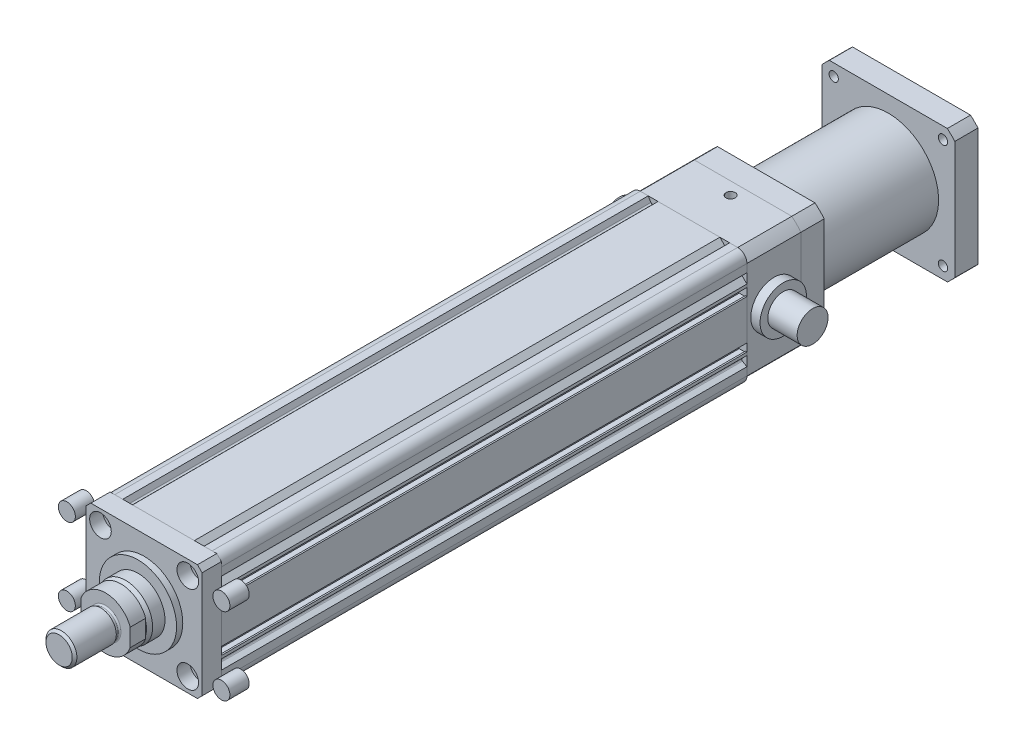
from build123d import *

# Parameters (mm, degrees)
SKETCH_1_R          = 31.5
SKETCH_1_R_2        = 3.35
EXTRUDE_1_DEPTH     = 340
SKETCH_2_R          = 5.5
EXTRUDE_1_2_DEPTH   = 12.5
EXTRUDE_1_2_2_DEPTH = 12.5
EXTRUDE_1_2_3_DEPTH = 12.5
EXTRUDE_1_2_4_DEPTH = 12.5
SKETCH_2_R_2        = 4.25
EXTRUDE_1_2_5_DEPTH = 12.5
SKETCH_3_R          = 7
SKETCH_3_R_2        = 4.25
CUT_EXTRUDE_1_DEPTH = 8.5
SKETCH_3_3_R        = 25
EXTRUDE_2_DEPTH     = 4
SKETCH_5_R          = 17.5
EXTRUDE_3_DEPTH     = 11
CHAMFER_1_SIZE      = 3
CHAMFER_1_SIZE2     = 1
EXTRUDE_4_DEPTH     = 10
SKETCH_8_R          = 9
EXTRUDE_5_DEPTH     = 3
SKETCH_9_R          = 10
EXTRUDE_6_DEPTH     = 27
CHAMFER_2_SIZE      = 1.5
FILLET_1_R          = 1
EXTRUDE_7_DEPTH     = 35
SKETCH_11_R         = 3
CUT_EXTRUDE_2_DEPTH = 5
EXTRUDE_8_DEPTH     = 15
SKETCH_13_R         = 32.5
EXTRUDE_9_DEPTH     = 79
SKETCH_14_R         = 3
EXTRUDE_10_DEPTH    = 15
SKETCH_15_R         = 40
CUT_EXTRUDE_3_DEPTH = 6
SKETCH_15_3_R       = 26
CUT_EXTRUDE_4_DEPTH = 101
SKETCH_18_R         = 10
EXTRUDE_11_DEPTH    = 25
EXTRUDE_START       = -75
SKETCH_18_2_R       = 10
EXTRUDE_12_DEPTH    = 25
SKETCH_19_R         = 15
SKETCH_19_R_2       = 10
EXTRUDE_13_DEPTH    = 6
SKETCH_19_2_R       = 15
SKETCH_19_2_R_2     = 10
EXTRUDE_14_DEPTH    = 6


with BuildPart() as part:
    # Sketch 1 → Extrude 1 (new body)
    with BuildSketch(Plane.XY):
        with BuildLine():
            Line((-31.5, 37.5), (-26.33, 37.5))
            Line((-26.33, 37.5), (-24.66467188, 34.615567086))
            ThreePointArc((-24.66467188, 34.615567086), (-23.929172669, 34.124122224), (-23.091539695, 34.408460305))
            Line((-23.091539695, 34.408460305), (-20, 37.5))
            Line((-20, 37.5), (20, 37.5))
            Line((20, 37.5), (23.091539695, 34.408460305))
            ThreePointArc((23.091539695, 34.408460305), (23.929172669, 34.124122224), (24.66467188, 34.615567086))
            Line((24.66467188, 34.615567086), (26.33, 37.5))
            Line((26.33, 37.5), (31.5, 37.5))
            ThreePointArc((31.5, 37.5), (35.742640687, 35.742640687), (37.5, 31.5))
            Line((37.5, 31.5), (37.5, 26.33))
            Line((37.5, 26.33), (34.615567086, 24.66467188))
            ThreePointArc((34.615567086, 24.66467188), (34.124122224, 23.929172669), (34.408460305, 23.091539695))
            Line((34.408460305, 23.091539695), (37.5, 20))
            Line((37.5, 20), (37.5, 18.1))
            Line((37.5, 18.1), (36.5, 18.1))
            Line((36.5, 18.1), (36.5, 18.7))
            Line((36.5, 18.7), (32.5, 18.7))
            Line((32.5, 18.7), (32.5, 12.4))
            Line((32.5, 12.4), (36.5, 12.4))
            Line((36.5, 12.4), (36.5, 13))
            Line((36.5, 13), (37.5, 13))
            Line((37.5, 13), (37.5, -13))
            Line((37.5, -13), (36.5, -13))
            Line((36.5, -13), (36.5, -12.4))
            Line((36.5, -12.4), (32.5, -12.4))
            Line((32.5, -12.4), (32.5, -18.7))
            Line((32.5, -18.7), (36.5, -18.7))
            Line((36.5, -18.7), (36.5, -18.1))
            Line((36.5, -18.1), (37.5, -18.1))
            Line((37.5, -18.1), (37.5, -20))
            Line((37.5, -20), (34.408460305, -23.091539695))
            ThreePointArc((34.408460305, -23.091539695), (34.124122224, -23.929172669), (34.615567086, -24.66467188))
            Line((34.615567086, -24.66467188), (37.5, -26.33))
            Line((37.5, -26.33), (37.5, -31.5))
            ThreePointArc((37.5, -31.5), (35.742640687, -35.742640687), (31.5, -37.5))
            Line((31.5, -37.5), (26.33, -37.5))
            Line((26.33, -37.5), (24.66467188, -34.615567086))
            ThreePointArc((24.66467188, -34.615567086), (23.929172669, -34.124122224), (23.091539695, -34.408460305))
            Line((23.091539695, -34.408460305), (20, -37.5))
            Line((20, -37.5), (18.1, -37.5))
            Line((18.1, -37.5), (18.1, -36.5))
            Line((18.1, -36.5), (18.7, -36.5))
            Line((18.7, -36.5), (18.7, -33.945032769))
            Line((18.7, -33.945032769), (12.4, -33.945032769))
            Line((12.4, -33.945032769), (12.4, -36.5))
            Line((12.4, -36.5), (13, -36.5))
            Line((13, -36.5), (13, -37.5))
            Line((13, -37.5), (-13, -37.5))
            Line((-13, -37.5), (-13, -36.5))
            Line((-13, -36.5), (-12.4, -36.5))
            Line((-12.4, -36.5), (-12.4, -33.945032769))
            Line((-12.4, -33.945032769), (-18.7, -33.945032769))
            Line((-18.7, -33.945032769), (-18.7, -36.5))
            Line((-18.7, -36.5), (-18.1, -36.5))
            Line((-18.1, -36.5), (-18.1, -37.5))
            Line((-18.1, -37.5), (-20, -37.5))
            Line((-20, -37.5), (-23.091539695, -34.408460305))
            ThreePointArc((-23.091539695, -34.408460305), (-23.929172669, -34.124122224), (-24.66467188, -34.615567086))
            Line((-24.66467188, -34.615567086), (-26.33, -37.5))
            Line((-26.33, -37.5), (-31.5, -37.5))
            ThreePointArc((-31.5, -37.5), (-35.742640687, -35.742640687), (-37.5, -31.5))
            Line((-37.5, -31.5), (-37.5, -26.33))
            Line((-37.5, -26.33), (-34.615567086, -24.66467188))
            ThreePointArc((-34.615567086, -24.66467188), (-34.124122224, -23.929172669), (-34.408460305, -23.091539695))
            Line((-34.408460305, -23.091539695), (-37.5, -20))
            Line((-37.5, -20), (-37.5, -18.1))
            Line((-37.5, -18.1), (-36.5, -18.1))
            Line((-36.5, -18.1), (-36.5, -18.7))
            Line((-36.5, -18.7), (-32.5, -18.7))
            Line((-32.5, -18.7), (-32.5, -12.4))
            Line((-32.5, -12.4), (-36.5, -12.4))
            Line((-36.5, -12.4), (-36.5, -13))
            Line((-36.5, -13), (-37.5, -13))
            Line((-37.5, -13), (-37.5, 13))
            Line((-37.5, 13), (-36.5, 13))
            Line((-36.5, 13), (-36.5, 12.4))
            Line((-36.5, 12.4), (-32.5, 12.4))
            Line((-32.5, 12.4), (-32.5, 18.7))
            Line((-32.5, 18.7), (-36.5, 18.7))
            Line((-36.5, 18.7), (-36.5, 18.1))
            Line((-36.5, 18.1), (-37.5, 18.1))
            Line((-37.5, 18.1), (-37.5, 20))
            Line((-37.5, 20), (-34.408460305, 23.091539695))
            ThreePointArc((-34.408460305, 23.091539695), (-34.124122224, 23.929172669), (-34.615567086, 24.66467188))
            Line((-34.615567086, 24.66467188), (-37.5, 26.33))
            Line((-37.5, 26.33), (-37.5, 31.5))
            ThreePointArc((-37.5, 31.5), (-35.742640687, 35.742640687), (-31.5, 37.5))
        make_face()
        Circle(SKETCH_1_R, mode=Mode.SUBTRACT)
        with Locations((-28.25, 28.25)):
            Circle(SKETCH_1_R_2, mode=Mode.SUBTRACT)
        with Locations(Location((28.25, 28.25, 0), (0, 0, 180))):
            Circle(SKETCH_1_R_2, mode=Mode.SUBTRACT)
        with Locations((28.25, -28.25)):
            Circle(SKETCH_1_R_2, mode=Mode.SUBTRACT)
        with Locations(Location((-28.25, -28.25, 0), (0, 0, 180))):
            Circle(SKETCH_1_R_2, mode=Mode.SUBTRACT)
    extrude(amount=EXTRUDE_1_DEPTH)


with BuildPart() as body_2:
    # Sketch 2 → Extrude 1 2 (new body)
    with BuildSketch(Plane.XY.offset(340)):
        with Locations((-50, 25)):
            Circle(SKETCH_2_R)
    extrude(amount=EXTRUDE_1_2_DEPTH)


with BuildPart() as body_3:
    # Sketch 2 → Extrude 1 2 2 (new body)
    with BuildSketch(Plane.XY.offset(340)):
        with Locations(Location((50, 25, 0), (0, 0, 180))):
            Circle(SKETCH_2_R)
    extrude(amount=EXTRUDE_1_2_2_DEPTH)


with BuildPart() as body_4:
    # Sketch 2 → Extrude 1 2 3 (new body)
    with BuildSketch(Plane.XY.offset(340)):
        with Locations(Location((-50, -25, 0), (0, 0, 180))):
            Circle(SKETCH_2_R)
    extrude(amount=EXTRUDE_1_2_3_DEPTH)


with BuildPart() as body_5:
    # Sketch 2 → Extrude 1 2 4 (new body)
    with BuildSketch(Plane.XY.offset(340)):
        with Locations((50, -25)):
            Circle(SKETCH_2_R)
    extrude(amount=EXTRUDE_1_2_4_DEPTH)


with BuildPart() as body_6:
    # Sketch 2 → Extrude 1 2 5 (new body)
    with BuildSketch(Plane.XY.offset(340)):
        Polygon((-37.5, 34.5), (-34.5, 37.5), (34.5, 37.5), (37.5, 34.5), (37.5, -34.5), (34.5, -37.5), (-34.5, -37.5), (-37.5, -34.5), align=None)
        with Locations((-28.25, 28.25)):
            Circle(SKETCH_2_R_2, mode=Mode.SUBTRACT)
        with Locations(Location((28.25, 28.25, 0), (0, 0, 180))):
            Circle(SKETCH_2_R_2, mode=Mode.SUBTRACT)
        with Locations(Location((-28.25, -28.25, 0), (0, 0, 180))):
            Circle(SKETCH_2_R_2, mode=Mode.SUBTRACT)
        with Locations((28.25, -28.25)):
            Circle(SKETCH_2_R_2, mode=Mode.SUBTRACT)
    extrude(amount=EXTRUDE_1_2_5_DEPTH)

    # Sketch 3 → Cut-Extrude 1 (cut)
    # profile 1 of 4: a face of its own
    with BuildSketch(Plane.XY.offset(352.5)):
        with Locations((28.25, -28.25)):
            Circle(SKETCH_3_R)
        with Locations((28.25, -28.25)):
            Circle(SKETCH_3_R_2, mode=Mode.SUBTRACT)
    # profile 2 of 4: a face of its own
    with BuildSketch(Plane.XY.offset(352.5)):
        with Locations((-28.25, -28.25)):
            Circle(SKETCH_3_R)
        with Locations(Location((-28.25, -28.25, 0), (0, 0, 180))):
            Circle(SKETCH_3_R_2, mode=Mode.SUBTRACT)
    # profile 3 of 4: a face of its own
    with BuildSketch(Plane.XY.offset(352.5)):
        with Locations((-28.25, 28.25)):
            Circle(SKETCH_3_R)
    # profile 4 of 4: a face of its own
    with BuildSketch(Plane.XY.offset(352.5)):
        with Locations((28.25, 28.25)):
            Circle(SKETCH_3_R)
    extrude(amount=-CUT_EXTRUDE_1_DEPTH, mode=Mode.SUBTRACT)

    # Sketch 3_3 → Extrude 2 (add)
    with BuildSketch(Plane.XY.offset(352.5)):
        Circle(SKETCH_3_3_R)
    extrude(amount=EXTRUDE_2_DEPTH)

    # Sketch 5 → Extrude 3 (add)
    with BuildSketch(Plane.XY.offset(356.5)):
        Circle(SKETCH_5_R)
    extrude(amount=EXTRUDE_3_DEPTH)

    # Chamfer 1
    chamfer_1_edges = [body_6.edges().sort_by_distance(p)[0] for p in [
        (-17.5, 0, 367.5),
    ]]
    chamfer_1_side = [body_6.faces().sort_by_distance(p)[0] for p in [
        (-17.5, 0, 362),
    ]]
    chamfer(chamfer_1_edges, length=CHAMFER_1_SIZE, length2=CHAMFER_1_SIZE2, reference=chamfer_1_side[0])

    # Sketch 6 → Extrude 4 (add)
    with BuildSketch(Plane.XY.offset(367.5)):
        with BuildLine():
            Line((-16, 5.744562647), (-16, -5.744562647))
            ThreePointArc((-16, -5.744562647), (0, -17), (16, -5.744562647))
            Line((16, -5.744562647), (16, 5.744562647))
            ThreePointArc((16, 5.744562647), (0, 17), (-16, 5.744562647))
        make_face()
    extrude(amount=EXTRUDE_4_DEPTH)

    # Sketch 8 → Extrude 5 (add)
    with BuildSketch(Plane.XY.offset(377.5)):
        Circle(SKETCH_8_R)
    extrude(amount=EXTRUDE_5_DEPTH)

    # Sketch 9 → Extrude 6 (add)
    with BuildSketch(Plane.XY.offset(380.5)):
        Circle(SKETCH_9_R)
    extrude(amount=EXTRUDE_6_DEPTH)

    # Chamfer 2
    chamfer_2_edges = [body_6.edges().sort_by_distance(p)[0] for p in [
        (-10, 0, 407.5),
    ]]
    chamfer(chamfer_2_edges, length=CHAMFER_2_SIZE)

    # Fillet 1
    fillet_1_edges = [body_6.edges().sort_by_distance(p)[0] for p in [
        (-9, 0, 377.5),
    ]]
    fillet(fillet_1_edges, radius=FILLET_1_R)


with BuildPart() as body_7:
    # Sketch 10 → Extrude 7 (new body)
    with BuildSketch(Plane(origin=(0, 0, 0), x_dir=(-1, 0, 0), z_dir=(0, 0, -1))):
        with BuildLine():
            Line((-31.539657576, 37.5), (31.539657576, 37.5))
            ThreePointArc((31.539657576, 37.5), (34.648232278, 34.648232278), (37.5, 31.539657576))
            Line((37.5, 31.539657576), (37.5, -31.539657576))
            ThreePointArc((37.5, -31.539657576), (34.648232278, -34.648232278), (31.539657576, -37.5))
            Line((31.539657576, -37.5), (-31.539657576, -37.5))
            ThreePointArc((-31.539657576, -37.5), (-34.648232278, -34.648232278), (-37.5, -31.539657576))
            Line((-37.5, -31.539657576), (-37.5, 31.539657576))
            ThreePointArc((-37.5, 31.539657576), (-34.648232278, 34.648232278), (-31.539657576, 37.5))
        make_face()
    extrude(amount=EXTRUDE_7_DEPTH)

    # Sketch 11 → Cut-Extrude 2 (cut)
    with BuildSketch(Plane(origin=(0, 37.5, 0), x_dir=(1, 0, 0), z_dir=(0, 1, 0))):
        with Locations(Location((0, 27, 0), (0, 0, 270))):
            Circle(SKETCH_11_R)
    extrude(amount=-CUT_EXTRUDE_2_DEPTH, mode=Mode.SUBTRACT)

    # Sketch 18 → Extrude 11 (add)
    with BuildSketch(Plane.ZY.offset(37.5)):
        with Locations((-17.5, 0)):
            Circle(SKETCH_18_R)
    extrude(amount=EXTRUDE_11_DEPTH)

    # Sketch 18_2 → Extrude 12 (add)
    with BuildSketch(Plane.ZY.offset(37.5).offset(EXTRUDE_START)):
        with Locations((-17.5, 0)):
            Circle(SKETCH_18_2_R)
    extrude(amount=-EXTRUDE_12_DEPTH)

    # Sketch 19 → Extrude 13 (add)
    with BuildSketch(Plane.ZY.offset(37.5)):
        with Locations(Location((-17.5, 0, 0), (0, 0, 180))):
            Circle(SKETCH_19_R)
        with Locations((-17.5, 0)):
            Circle(SKETCH_19_R_2, mode=Mode.SUBTRACT)
    extrude(amount=EXTRUDE_13_DEPTH)

    # Sketch 19_2 → Extrude 14 (add)
    with BuildSketch(Plane.ZY.offset(37.5).offset(EXTRUDE_START)):
        with Locations(Location((-17.5, 0, 0), (0, 0, 180))):
            Circle(SKETCH_19_2_R)
        with Locations((-17.5, 0)):
            Circle(SKETCH_19_2_R_2, mode=Mode.SUBTRACT)
    extrude(amount=-EXTRUDE_14_DEPTH)


with BuildPart() as body_8:
    # Sketch 12 → Extrude 8 (new body)
    with BuildSketch(Plane(origin=(0, 0, -35), x_dir=(-1, 0, 0), z_dir=(0, 0, -1))):
        with BuildLine():
            Line((-31.539657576, 37.5), (31.539657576, 37.5))
            ThreePointArc((31.539657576, 37.5), (34.648232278, 34.648232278), (37.5, 31.539657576))
            Line((37.5, 31.539657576), (37.5, -31.539657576))
            ThreePointArc((37.5, -31.539657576), (34.648232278, -34.648232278), (31.539657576, -37.5))
            Line((31.539657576, -37.5), (-31.539657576, -37.5))
            ThreePointArc((-31.539657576, -37.5), (-34.648232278, -34.648232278), (-37.5, -31.539657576))
            Line((-37.5, -31.539657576), (-37.5, 31.539657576))
            ThreePointArc((-37.5, 31.539657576), (-34.648232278, 34.648232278), (-31.539657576, 37.5))
        make_face()
    extrude(amount=EXTRUDE_8_DEPTH)

    # Sketch 13 → Extrude 9 (add)
    with BuildSketch(Plane(origin=(0, 0, -50), x_dir=(-1, 0, 0), z_dir=(0, 0, -1))):
        Circle(SKETCH_13_R)
    extrude(amount=EXTRUDE_9_DEPTH)

    # Sketch 14 → Extrude 10 (add)
    with BuildSketch(Plane(origin=(0, 0, -129), x_dir=(-1, 0, 0), z_dir=(0, 0, -1))):
        with BuildLine():
            Line((-38.173943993, 43), (38.173943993, 43))
            ThreePointArc((38.173943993, 43), (40.658639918, 40.658639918), (43, 38.173943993))
            Line((43, 38.173943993), (43, -38.173943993))
            ThreePointArc((43, -38.173943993), (40.658639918, -40.658639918), (38.173943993, -43))
            Line((38.173943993, -43), (-38.173943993, -43))
            ThreePointArc((-38.173943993, -43), (-40.658639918, -40.658639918), (-43, -38.173943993))
            Line((-43, -38.173943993), (-43, 38.173943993))
            ThreePointArc((-43, 38.173943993), (-40.658639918, 40.658639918), (-38.173943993, 43))
        make_face()
        with Locations((-35.355339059, 35.355339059)):
            Circle(SKETCH_14_R, mode=Mode.SUBTRACT)
        with Locations((35.355339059, 35.355339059)):
            Circle(SKETCH_14_R, mode=Mode.SUBTRACT)
        with Locations((35.355339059, -35.355339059)):
            Circle(SKETCH_14_R, mode=Mode.SUBTRACT)
        with Locations((-35.355339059, -35.355339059)):
            Circle(SKETCH_14_R, mode=Mode.SUBTRACT)
    extrude(amount=EXTRUDE_10_DEPTH)

    # Sketch 15 → Cut-Extrude 3 (cut)
    with BuildSketch(Plane(origin=(0, 0, -144), x_dir=(-1, 0, 0), z_dir=(0, 0, -1))):
        Circle(SKETCH_15_R)
    extrude(amount=-CUT_EXTRUDE_3_DEPTH, mode=Mode.SUBTRACT)

    # Sketch 15_3 → Cut-Extrude 4 (cut)
    with BuildSketch(Plane(origin=(0, 0, -144), x_dir=(-1, 0, 0), z_dir=(0, 0, -1))):
        Circle(SKETCH_15_3_R)
    extrude(amount=-CUT_EXTRUDE_4_DEPTH, mode=Mode.SUBTRACT)


solid = Compound([part.part, body_2.part, body_3.part, body_4.part, body_5.part, body_6.part, body_7.part, body_8.part])
